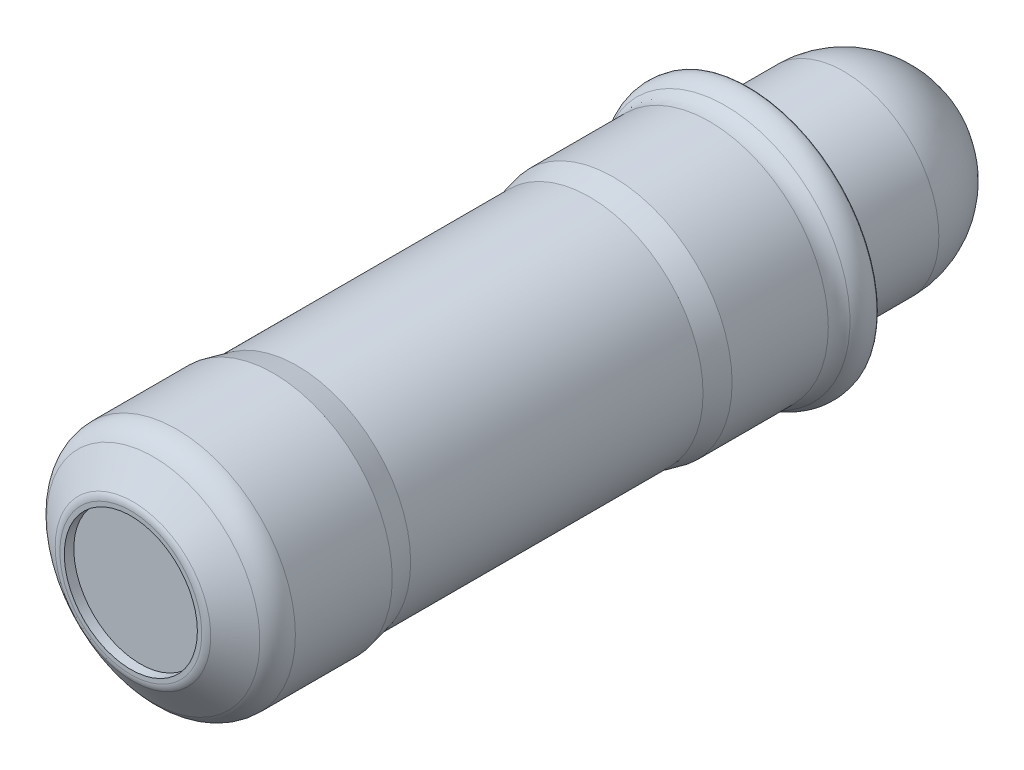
ISO-10303-21;
HEADER;
FILE_DESCRIPTION(('STEP AP214'),'2;1');
FILE_NAME('part.step','',(''),(''),'','','');
FILE_SCHEMA(('AUTOMOTIVE_DESIGN { 1 0 10303 214 1 1 1 1 }'));
ENDSEC;
DATA;
#1=APPLICATION_CONTEXT('core data for automotive mechanical design processes');
#2=APPLICATION_PROTOCOL_DEFINITION('international standard','automotive_design',2000,#1);
#3=PRODUCT_CONTEXT('',#1,'mechanical');
#4=PRODUCT('Part','Part','',(#3));
#5=PRODUCT_RELATED_PRODUCT_CATEGORY('part','',(#4));
#6=PRODUCT_DEFINITION_FORMATION('','',#4);
#7=PRODUCT_DEFINITION_CONTEXT('part definition',#1,'design');
#8=PRODUCT_DEFINITION('design','',#6,#7);
#9=PRODUCT_DEFINITION_SHAPE('','',#8);
#10=(LENGTH_UNIT() NAMED_UNIT(*) SI_UNIT(.MILLI.,.METRE.));
#11=(NAMED_UNIT(*) PLANE_ANGLE_UNIT() SI_UNIT($,.RADIAN.));
#12=(NAMED_UNIT(*) SI_UNIT($,.STERADIAN.) SOLID_ANGLE_UNIT());
#13=UNCERTAINTY_MEASURE_WITH_UNIT(LENGTH_MEASURE(1.E-05),#10,'distance_accuracy_value','');
#14=(GEOMETRIC_REPRESENTATION_CONTEXT(3) GLOBAL_UNCERTAINTY_ASSIGNED_CONTEXT((#13)) GLOBAL_UNIT_ASSIGNED_CONTEXT((#10,
#11,#12)) REPRESENTATION_CONTEXT('',''));
#15=CARTESIAN_POINT('',(0.,0.,0.));
#16=DIRECTION('',(0.,0.,1.));
#17=DIRECTION('',(1.,0.,0.));
#18=AXIS2_PLACEMENT_3D('',#15,#16,#17);
#19=CARTESIAN_POINT('',(0.,0.,8.));
#20=DIRECTION('',(0.,0.,1.));
#21=DIRECTION('',(1.,0.,0.));
#22=AXIS2_PLACEMENT_3D('',#19,#20,#21);
#23=CYLINDRICAL_SURFACE('',#22,2.8);
#24=CARTESIAN_POINT('',(0.,0.,34.));
#25=DIRECTION('',(0.,0.,1.));
#26=DIRECTION('',(1.,0.,0.));
#27=AXIS2_PLACEMENT_3D('',#24,#25,#26);
#28=CIRCLE('',#27,2.8);
#29=CARTESIAN_POINT('',(2.8,0.,34.));
#30=VERTEX_POINT('',#29);
#31=EDGE_CURVE('E148',#30,#30,#28,.F.);
#32=ORIENTED_EDGE('',*,*,#31,.F.);
#33=EDGE_LOOP('',(#32));
#34=FACE_BOUND('',#33,.T.);
#35=CARTESIAN_POINT('',(0.,0.,33.6));
#36=DIRECTION('',(0.,0.,1.));
#37=DIRECTION('',(1.,0.,0.));
#38=AXIS2_PLACEMENT_3D('',#35,#36,#37);
#39=CIRCLE('',#38,2.8);
#40=CARTESIAN_POINT('',(2.8,0.,33.6));
#41=VERTEX_POINT('',#40);
#42=EDGE_CURVE('E151',#41,#41,#39,.T.);
#43=ORIENTED_EDGE('',*,*,#42,.F.);
#44=EDGE_LOOP('',(#43));
#45=FACE_BOUND('',#44,.T.);
#46=ADVANCED_FACE('F12',(#34,#45),#23,.F.);
#47=CARTESIAN_POINT('',(0.,2.98575819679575,34.));
#48=DIRECTION('',(0.,0.,1.));
#49=DIRECTION('',(1.,0.,0.));
#50=AXIS2_PLACEMENT_3D('',#47,#48,#49);
#51=PLANE('',#50);
#52=CARTESIAN_POINT('',(0.,0.,34.));
#53=DIRECTION('',(0.,0.,-1.));
#54=DIRECTION('',(-1.,0.,0.));
#55=AXIS2_PLACEMENT_3D('',#52,#53,#54);
#56=CIRCLE('',#55,2.98575819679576);
#57=CARTESIAN_POINT('',(-2.98575819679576,0.,34.));
#58=VERTEX_POINT('',#57);
#59=EDGE_CURVE('E122',#58,#58,#56,.T.);
#60=ORIENTED_EDGE('',*,*,#59,.F.);
#61=EDGE_LOOP('',(#60));
#62=FACE_BOUND('',#61,.T.);
#63=ORIENTED_EDGE('',*,*,#31,.T.);
#64=EDGE_LOOP('',(#63));
#65=FACE_BOUND('',#64,.T.);
#66=ADVANCED_FACE('F127',(#62,#65),#51,.T.);
#67=CARTESIAN_POINT('',(0.,3.99,8.));
#68=DIRECTION('',(0.,0.,-1.));
#69=DIRECTION('',(-1.,0.,0.));
#70=AXIS2_PLACEMENT_3D('',#67,#68,#69);
#71=PLANE('',#70);
#72=CARTESIAN_POINT('',(0.,0.,8.));
#73=DIRECTION('',(0.,0.,-1.));
#74=DIRECTION('',(-1.,0.,0.));
#75=AXIS2_PLACEMENT_3D('',#72,#73,#74);
#76=CIRCLE('',#75,4.);
#77=CARTESIAN_POINT('',(-4.,0.,8.));
#78=VERTEX_POINT('',#77);
#79=EDGE_CURVE('E15',#78,#78,#76,.F.);
#80=ORIENTED_EDGE('',*,*,#79,.T.);
#81=EDGE_LOOP('',(#80));
#82=FACE_BOUND('',#81,.T.);
#83=CARTESIAN_POINT('',(0.,0.,7.99999999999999));
#84=DIRECTION('',(0.,0.,1.));
#85=DIRECTION('',(-1.,0.,0.));
#86=AXIS2_PLACEMENT_3D('',#83,#84,#85);
#87=CIRCLE('',#86,5.37037999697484);
#88=CARTESIAN_POINT('',(-5.37037999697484,0.,7.99999999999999));
#89=VERTEX_POINT('',#88);
#90=EDGE_CURVE('E89',#89,#89,#87,.T.);
#91=ORIENTED_EDGE('',*,*,#90,.F.);
#92=EDGE_LOOP('',(#91));
#93=FACE_BOUND('',#92,.T.);
#94=ADVANCED_FACE('F135',(#82,#93),#71,.T.);
#95=CARTESIAN_POINT('',(0.,0.,33.5));
#96=DIRECTION('',(0.,0.,-1.));
#97=DIRECTION('',(-1.,0.,0.));
#98=AXIS2_PLACEMENT_3D('',#95,#96,#97);
#99=TOROIDAL_SURFACE('',#98,2.98575819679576,0.5);
#100=CARTESIAN_POINT('',(0.,0.,33.9095760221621));
#101=DIRECTION('',(0.,0.,-1.));
#102=DIRECTION('',(-1.,0.,0.));
#103=AXIS2_PLACEMENT_3D('',#100,#101,#102);
#104=CIRCLE('',#103,3.27254641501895);
#105=CARTESIAN_POINT('',(-3.27254641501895,0.,33.9095760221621));
#106=VERTEX_POINT('',#105);
#107=EDGE_CURVE('E84',#106,#106,#104,.T.);
#108=ORIENTED_EDGE('',*,*,#107,.F.);
#109=EDGE_LOOP('',(#108));
#110=FACE_BOUND('',#109,.T.);
#111=ORIENTED_EDGE('',*,*,#59,.T.);
#112=EDGE_LOOP('',(#111));
#113=FACE_BOUND('',#112,.T.);
#114=ADVANCED_FACE('F102',(#110,#113),#99,.T.);
#115=CARTESIAN_POINT('',(0.,0.,8.0999999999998));
#116=DIRECTION('',(0.,0.,-1.));
#117=DIRECTION('',(-1.,0.,0.));
#118=AXIS2_PLACEMENT_3D('',#115,#116,#117);
#119=TOROIDAL_SURFACE('',#118,5.37038019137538,0.0999999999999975);
#120=ORIENTED_EDGE('',*,*,#90,.T.);
#121=EDGE_LOOP('',(#120));
#122=FACE_BOUND('',#121,.T.);
#123=CARTESIAN_POINT('',(0.,0.,8.0740000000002));
#124=DIRECTION('',(0.,0.,-1.));
#125=DIRECTION('',(-1.,0.,0.));
#126=AXIS2_PLACEMENT_3D('',#123,#124,#125);
#127=CIRCLE('',#126,5.46694105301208);
#128=CARTESIAN_POINT('',(-5.46694105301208,0.,8.0740000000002));
#129=VERTEX_POINT('',#128);
#130=EDGE_CURVE('E78',#129,#129,#127,.F.);
#131=ORIENTED_EDGE('',*,*,#130,.F.);
#132=EDGE_LOOP('',(#131));
#133=FACE_BOUND('',#132,.T.);
#134=ADVANCED_FACE('F97',(#122,#133),#119,.T.);
#135=CARTESIAN_POINT('',(0.,0.,33.058301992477));
#136=DIRECTION('',(0.,0.,-1.));
#137=DIRECTION('',(-1.,0.,0.));
#138=AXIS2_PLACEMENT_3D('',#135,#136,#137);
#139=CONICAL_SURFACE('',#138,4.4882917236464,0.959931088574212);
#140=CARTESIAN_POINT('',(0.,0.,33.0583019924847));
#141=DIRECTION('',(0.,0.,-1.));
#142=DIRECTION('',(-1.,0.,0.));
#143=AXIS2_PLACEMENT_3D('',#140,#141,#142);
#144=CIRCLE('',#143,4.48829172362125);
#145=CARTESIAN_POINT('',(-4.48829172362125,0.,33.0583019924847));
#146=VERTEX_POINT('',#145);
#147=EDGE_CURVE('E75',#146,#146,#144,.T.);
#148=ORIENTED_EDGE('',*,*,#147,.F.);
#149=EDGE_LOOP('',(#148));
#150=FACE_BOUND('',#149,.T.);
#151=ORIENTED_EDGE('',*,*,#107,.T.);
#152=EDGE_LOOP('',(#151));
#153=FACE_BOUND('',#152,.T.);
#154=ADVANCED_FACE('F101',(#150,#153),#139,.T.);
#155=CARTESIAN_POINT('',(0.,0.,8.329));
#156=DIRECTION('',(0.,0.,-1.));
#157=DIRECTION('',(-1.,0.,0.));
#158=AXIS2_PLACEMENT_3D('',#155,#156,#157);
#159=TOROIDAL_SURFACE('',#158,4.5,1.);
#160=ORIENTED_EDGE('',*,*,#130,.T.);
#161=EDGE_LOOP('',(#160));
#162=FACE_BOUND('',#161,.T.);
#163=CARTESIAN_POINT('',(0.,0.,8.99043782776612));
#164=DIRECTION('',(0.,0.,-1.));
#165=DIRECTION('',(-1.,0.,0.));
#166=AXIS2_PLACEMENT_3D('',#163,#164,#165);
#167=CIRCLE('',#166,5.25);
#168=CARTESIAN_POINT('',(-5.25,0.,8.99043782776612));
#169=VERTEX_POINT('',#168);
#170=EDGE_CURVE('E50',#169,#169,#167,.T.);
#171=ORIENTED_EDGE('',*,*,#170,.T.);
#172=EDGE_LOOP('',(#171));
#173=FACE_BOUND('',#172,.T.);
#174=ADVANCED_FACE('F68',(#162,#173),#159,.T.);
#175=CARTESIAN_POINT('',(0.,0.,32.0753195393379));
#176=DIRECTION('',(0.,0.,-1.));
#177=DIRECTION('',(-1.,0.,0.));
#178=AXIS2_PLACEMENT_3D('',#175,#176,#177);
#179=TOROIDAL_SURFACE('',#178,3.8,1.2);
#180=CARTESIAN_POINT('',(0.,0.,32.0753195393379));
#181=DIRECTION('',(0.,0.,1.));
#182=DIRECTION('',(1.,0.,0.));
#183=AXIS2_PLACEMENT_3D('',#180,#181,#182);
#184=CIRCLE('',#183,5.);
#185=CARTESIAN_POINT('',(5.,0.,32.0753195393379));
#186=VERTEX_POINT('',#185);
#187=EDGE_CURVE('E45',#186,#186,#184,.F.);
#188=ORIENTED_EDGE('',*,*,#187,.F.);
#189=EDGE_LOOP('',(#188));
#190=FACE_BOUND('',#189,.T.);
#191=ORIENTED_EDGE('',*,*,#147,.T.);
#192=EDGE_LOOP('',(#191));
#193=FACE_BOUND('',#192,.T.);
#194=ADVANCED_FACE('F62',(#190,#193),#179,.T.);
#195=CARTESIAN_POINT('',(0.,0.,9.6518756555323));
#196=DIRECTION('',(0.,0.,-1.));
#197=DIRECTION('',(-1.,0.,0.));
#198=AXIS2_PLACEMENT_3D('',#195,#196,#197);
#199=TOROIDAL_SURFACE('',#198,6.,1.00000000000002);
#200=CARTESIAN_POINT('',(0.,0.,9.6518756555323));
#201=DIRECTION('',(0.,0.,1.));
#202=DIRECTION('',(1.,0.,0.));
#203=AXIS2_PLACEMENT_3D('',#200,#201,#202);
#204=CIRCLE('',#203,5.);
#205=CARTESIAN_POINT('',(5.,0.,9.6518756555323));
#206=VERTEX_POINT('',#205);
#207=EDGE_CURVE('E40',#206,#206,#204,.T.);
#208=ORIENTED_EDGE('',*,*,#207,.F.);
#209=EDGE_LOOP('',(#208));
#210=FACE_BOUND('',#209,.T.);
#211=ORIENTED_EDGE('',*,*,#170,.F.);
#212=EDGE_LOOP('',(#211));
#213=FACE_BOUND('',#212,.T.);
#214=ADVANCED_FACE('F57',(#210,#213),#199,.F.);
#215=CARTESIAN_POINT('',(0.,0.,8.));
#216=DIRECTION('',(0.,0.,1.));
#217=DIRECTION('',(1.,0.,0.));
#218=AXIS2_PLACEMENT_3D('',#215,#216,#217);
#219=CYLINDRICAL_SURFACE('',#218,5.);
#220=CARTESIAN_POINT('',(0.,0.,28.0000000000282));
#221=DIRECTION('',(0.,0.,1.));
#222=DIRECTION('',(1.,0.,0.));
#223=AXIS2_PLACEMENT_3D('',#220,#221,#222);
#224=CIRCLE('',#223,4.99999999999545);
#225=CARTESIAN_POINT('',(4.99999999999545,0.,28.0000000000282));
#226=VERTEX_POINT('',#225);
#227=EDGE_CURVE('E35',#226,#226,#224,.F.);
#228=ORIENTED_EDGE('',*,*,#227,.F.);
#229=EDGE_LOOP('',(#228));
#230=FACE_BOUND('',#229,.T.);
#231=ORIENTED_EDGE('',*,*,#187,.T.);
#232=EDGE_LOOP('',(#231));
#233=FACE_BOUND('',#232,.T.);
#234=ADVANCED_FACE('F61',(#230,#233),#219,.T.);
#235=CARTESIAN_POINT('',(0.,0.,8.));
#236=DIRECTION('',(0.,0.,1.));
#237=DIRECTION('',(1.,0.,0.));
#238=AXIS2_PLACEMENT_3D('',#235,#236,#237);
#239=CYLINDRICAL_SURFACE('',#238,5.);
#240=ORIENTED_EDGE('',*,*,#207,.T.);
#241=EDGE_LOOP('',(#240));
#242=FACE_BOUND('',#241,.T.);
#243=CARTESIAN_POINT('',(0.,0.,13.6999999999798));
#244=DIRECTION('',(0.,0.,-1.));
#245=DIRECTION('',(-1.,0.,0.));
#246=AXIS2_PLACEMENT_3D('',#243,#244,#245);
#247=CIRCLE('',#246,4.99999999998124);
#248=CARTESIAN_POINT('',(-4.99999999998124,0.,13.6999999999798));
#249=VERTEX_POINT('',#248);
#250=EDGE_CURVE('E24',#249,#249,#247,.F.);
#251=ORIENTED_EDGE('',*,*,#250,.F.);
#252=EDGE_LOOP('',(#251));
#253=FACE_BOUND('',#252,.T.);
#254=ADVANCED_FACE('F237',(#242,#253),#239,.T.);
#255=CARTESIAN_POINT('',(0.,0.,28.0000000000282));
#256=DIRECTION('',(0.,0.,1.));
#257=DIRECTION('',(1.,0.,0.));
#258=AXIS2_PLACEMENT_3D('',#255,#256,#257);
#259=CONICAL_SURFACE('',#258,4.99999999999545,0.221656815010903);
#260=CARTESIAN_POINT('',(0.,0.,27.0015962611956));
#261=DIRECTION('',(0.,0.,1.));
#262=DIRECTION('',(1.,0.,0.));
#263=AXIS2_PLACEMENT_3D('',#260,#261,#262);
#264=CIRCLE('',#263,4.775);
#265=CARTESIAN_POINT('',(4.775,0.,27.0015962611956));
#266=VERTEX_POINT('',#265);
#267=EDGE_CURVE('E19',#266,#266,#264,.F.);
#268=ORIENTED_EDGE('',*,*,#267,.F.);
#269=EDGE_LOOP('',(#268));
#270=FACE_BOUND('',#269,.T.);
#271=ORIENTED_EDGE('',*,*,#227,.T.);
#272=EDGE_LOOP('',(#271));
#273=FACE_BOUND('',#272,.T.);
#274=ADVANCED_FACE('F244',(#270,#273),#259,.T.);
#275=CARTESIAN_POINT('',(0.,0.,13.6999999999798));
#276=DIRECTION('',(0.,0.,-1.));
#277=DIRECTION('',(-1.,0.,0.));
#278=AXIS2_PLACEMENT_3D('',#275,#276,#277);
#279=CONICAL_SURFACE('',#278,4.99999999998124,0.221656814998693);
#280=ORIENTED_EDGE('',*,*,#250,.T.);
#281=EDGE_LOOP('',(#280));
#282=FACE_BOUND('',#281,.T.);
#283=CARTESIAN_POINT('',(0.,0.,14.6984037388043));
#284=DIRECTION('',(0.,0.,1.));
#285=DIRECTION('',(1.,0.,0.));
#286=AXIS2_PLACEMENT_3D('',#283,#284,#285);
#287=CIRCLE('',#286,4.775);
#288=CARTESIAN_POINT('',(4.775,0.,14.6984037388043));
#289=VERTEX_POINT('',#288);
#290=EDGE_CURVE('E8',#289,#289,#287,.T.);
#291=ORIENTED_EDGE('',*,*,#290,.F.);
#292=EDGE_LOOP('',(#291));
#293=FACE_BOUND('',#292,.T.);
#294=ADVANCED_FACE('F184',(#282,#293),#279,.T.);
#295=CARTESIAN_POINT('',(0.,0.,8.));
#296=DIRECTION('',(0.,0.,1.));
#297=DIRECTION('',(1.,0.,0.));
#298=AXIS2_PLACEMENT_3D('',#295,#296,#297);
#299=CYLINDRICAL_SURFACE('',#298,4.775);
#300=ORIENTED_EDGE('',*,*,#290,.T.);
#301=EDGE_LOOP('',(#300));
#302=FACE_BOUND('',#301,.T.);
#303=ORIENTED_EDGE('',*,*,#267,.T.);
#304=EDGE_LOOP('',(#303));
#305=FACE_BOUND('',#304,.T.);
#306=ADVANCED_FACE('F174',(#302,#305),#299,.T.);
#307=CARTESIAN_POINT('',(0.,0.,4.));
#308=DIRECTION('',(0.,0.,1.));
#309=DIRECTION('',(-1.,0.,0.));
#310=AXIS2_PLACEMENT_3D('',#307,#308,#309);
#311=SPHERICAL_SURFACE('',#310,4.);
#312=CARTESIAN_POINT('',(0.,0.,4.));
#313=DIRECTION('',(0.,0.,1.));
#314=DIRECTION('',(1.,0.,0.));
#315=AXIS2_PLACEMENT_3D('',#312,#313,#314);
#316=CIRCLE('',#315,4.);
#317=CARTESIAN_POINT('',(4.,0.,4.));
#318=VERTEX_POINT('',#317);
#319=EDGE_CURVE('E28',#318,#318,#316,.T.);
#320=ORIENTED_EDGE('',*,*,#319,.F.);
#321=EDGE_LOOP('',(#320));
#322=FACE_BOUND('',#321,.T.);
#323=ADVANCED_FACE('F172',(#322),#311,.T.);
#324=CARTESIAN_POINT('',(0.,0.,36.2332652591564));
#325=DIRECTION('',(0.,0.,1.));
#326=DIRECTION('',(1.,0.,0.));
#327=AXIS2_PLACEMENT_3D('',#324,#325,#326);
#328=CYLINDRICAL_SURFACE('',#327,4.);
#329=ORIENTED_EDGE('',*,*,#79,.F.);
#330=EDGE_LOOP('',(#329));
#331=FACE_BOUND('',#330,.T.);
#332=ORIENTED_EDGE('',*,*,#319,.T.);
#333=EDGE_LOOP('',(#332));
#334=FACE_BOUND('',#333,.T.);
#335=ADVANCED_FACE('F170',(#331,#334),#328,.T.);
#336=CARTESIAN_POINT('',(0.,0.,33.6));
#337=DIRECTION('',(0.,0.,-1.));
#338=DIRECTION('',(-1.,0.,0.));
#339=AXIS2_PLACEMENT_3D('',#336,#337,#338);
#340=PLANE('',#339);
#341=ORIENTED_EDGE('',*,*,#42,.T.);
#342=EDGE_LOOP('',(#341));
#343=FACE_BOUND('',#342,.T.);
#344=ADVANCED_FACE('F181',(#343),#340,.F.);
#345=CLOSED_SHELL('',(#46,#66,#94,#114,#134,#154,#174,#194,#214,#234,#254,#274,#294,#306,#323,
#335,#344));
#346=MANIFOLD_SOLID_BREP('B1',#345);
#347=ADVANCED_BREP_SHAPE_REPRESENTATION('',(#18,#346),#14);
#348=SHAPE_DEFINITION_REPRESENTATION(#9,#347);
ENDSEC;
END-ISO-10303-21;
